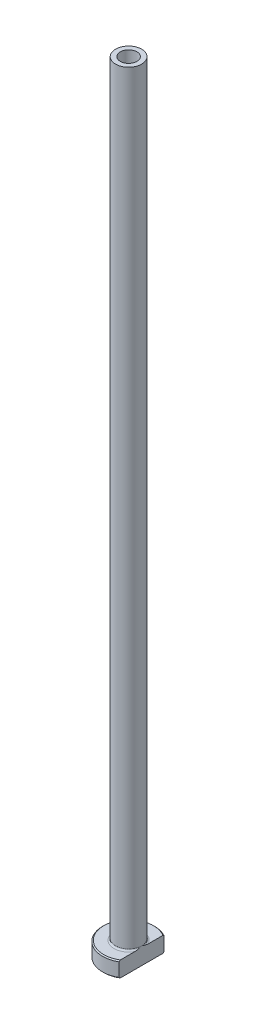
from build123d import *

# Parameters (mm, degrees)
FILLET1_R          = 0.3
CHAMFER1_SIZE      = 0.2
CUT_EXTRUDE1_DEPTH = 151.166574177
CHAMFER2_SIZE      = 0.5


with BuildPart() as part:
    # Sketch1 → Revolve1 (revolve)
    with BuildSketch(Plane.XY, mode=Mode.PRIVATE) as revolve1_sk:
        Polygon((-1.6, 150), (-2.5, 150), (-2.5, 3), (-5, 3), (-5, 0), (-1.85, 0), (-1.85, 93), (-1.6, 105), align=None)
    revolve(revolve1_sk.sketch.rotate(Axis((0, 92.187680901, 0), (0, -1, 0)), 270), axis=Axis((0, 92.187680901, 0), (0, -1, 0)))

    # Fillet1
    fillet1_edges = [part.edges().sort_by_distance(p)[0] for p in [
        (0, 3, -2.5),
    ]]
    fillet(fillet1_edges, radius=FILLET1_R)

    # Chamfer1
    chamfer1_edges = [part.edges().sort_by_distance(p)[0] for p in [
        (0, 0, -5),
        (0, 3, -5),
    ]]
    chamfer(chamfer1_edges, length=CHAMFER1_SIZE)

    # Sketch2 → Cut-Extrude1 (cut, through all)
    with BuildSketch(Plane.XZ):
        with BuildLine():
            Line((2.5, 4.330127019), (2.5, -4.330127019))
            ThreePointArc((2.5, -4.330127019), (5, 0), (2.5, 4.330127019))
        make_face()
    extrude(amount=-CUT_EXTRUDE1_DEPTH, mode=Mode.SUBTRACT)

    # Chamfer2
    chamfer2_edges = [part.edges().sort_by_distance(p)[0] for p in [
        (0, 0, -1.85),
    ]]
    chamfer(chamfer2_edges, length=CHAMFER2_SIZE)


solid = part.part
